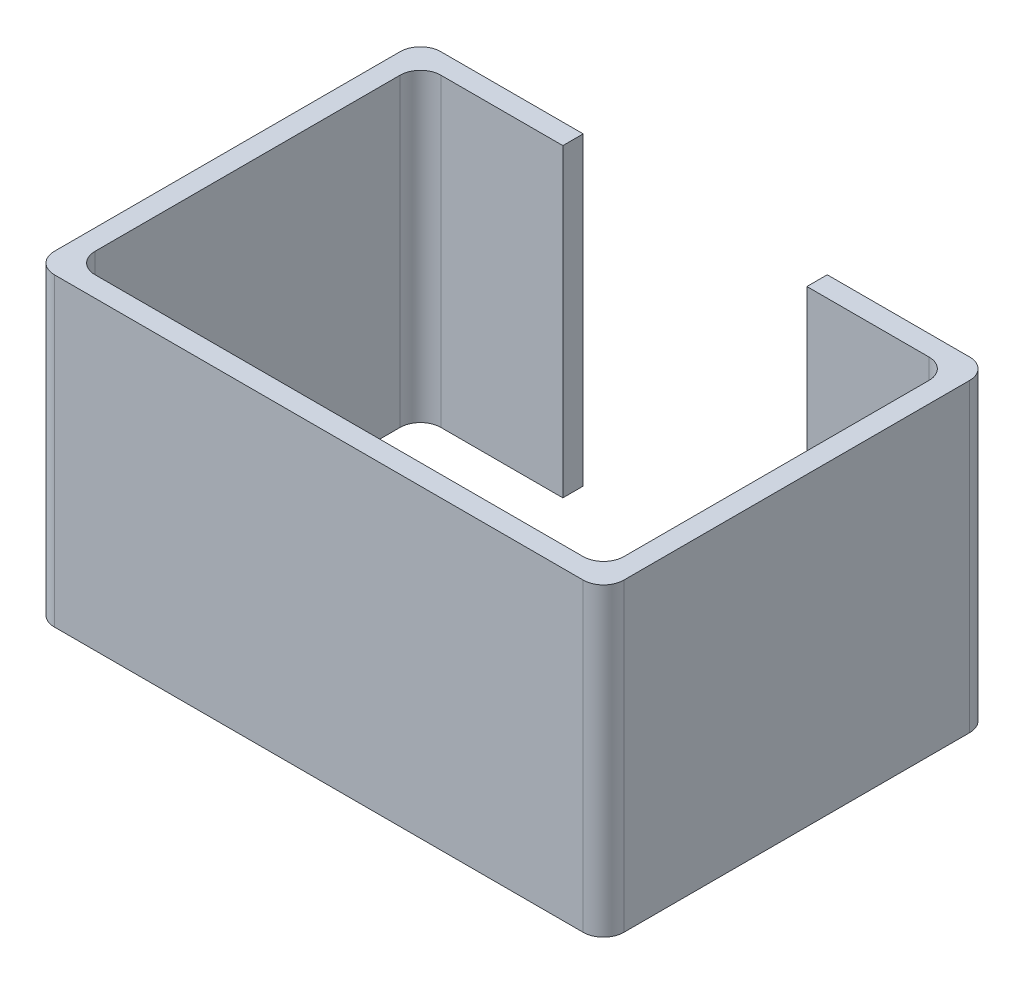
from build123d import *

# Parameters (mm, degrees)
EXTRUDE1_DEPTH = 15
FILLET1_R      = 1
FILLET2_R      = 1
FILLET4_R      = 1
FILLET5_R      = 1
FILLET6_R      = 1
FILLET7_R      = 1
FILLET8_R      = 1
FILLET9_R      = 1


with BuildPart() as part:
    # Sketch1 → Extrude1 (new body)
    with BuildSketch(Plane(origin=(0, 0, 0), x_dir=(1, 0, 0), z_dir=(0, 1, 0))):
        Polygon((0, 0), (-8, 0), (-8, -19), (20, -19), (20, 0), (12, 0), (12, -1), (19, -1), (19, -18), (-7, -18), (-7, -1), (0, -1), align=None)
    extrude(amount=EXTRUDE1_DEPTH)

    # Fillet1
    fillet1_edges = [part.edges().sort_by_distance(p)[0] for p in [
        (20, 7.5, 19),
    ]]
    fillet(fillet1_edges, radius=FILLET1_R)

    # Fillet2
    fillet2_edges = [part.edges().sort_by_distance(p)[0] for p in [
        (-8, 7.5, 19),
    ]]
    fillet(fillet2_edges, radius=FILLET2_R)

    # Fillet4
    fillet4_edges = [part.edges().sort_by_distance(p)[0] for p in [
        (20, 7.5, 0),
    ]]
    fillet(fillet4_edges, radius=FILLET4_R)

    # Fillet5
    fillet5_edges = [part.edges().sort_by_distance(p)[0] for p in [
        (-7, 7.5, 18),
    ]]
    fillet(fillet5_edges, radius=FILLET5_R)

    # Fillet6
    fillet6_edges = [part.edges().sort_by_distance(p)[0] for p in [
        (19, 7.5, 18),
    ]]
    fillet(fillet6_edges, radius=FILLET6_R)

    # Fillet7
    fillet7_edges = [part.edges().sort_by_distance(p)[0] for p in [
        (-8, 7.5, 0),
    ]]
    fillet(fillet7_edges, radius=FILLET7_R)

    # Fillet8
    fillet8_edges = [part.edges().sort_by_distance(p)[0] for p in [
        (19, 7.5, 1),
    ]]
    fillet(fillet8_edges, radius=FILLET8_R)

    # Fillet9
    fillet9_edges = [part.edges().sort_by_distance(p)[0] for p in [
        (-7, 7.5, 1),
    ]]
    fillet(fillet9_edges, radius=FILLET9_R)


solid = part.part
